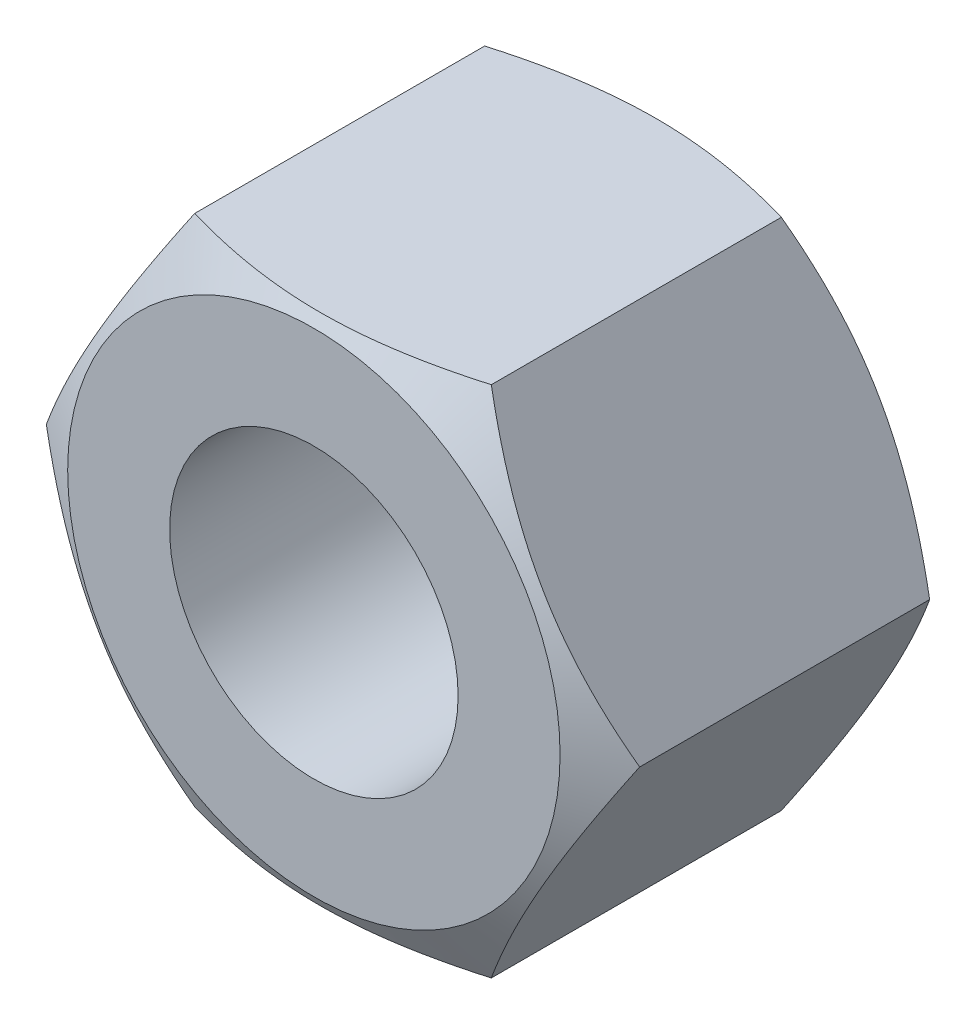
ISO-10303-21;
HEADER;
FILE_DESCRIPTION(('STEP AP214'),'2;1');
FILE_NAME('part.step','',(''),(''),'','','');
FILE_SCHEMA(('AUTOMOTIVE_DESIGN { 1 0 10303 214 1 1 1 1 }'));
ENDSEC;
DATA;
#1=APPLICATION_CONTEXT('core data for automotive mechanical design processes');
#2=APPLICATION_PROTOCOL_DEFINITION('international standard','automotive_design',2000,#1);
#3=PRODUCT_CONTEXT('',#1,'mechanical');
#4=PRODUCT('Part','Part','',(#3));
#5=PRODUCT_RELATED_PRODUCT_CATEGORY('part','',(#4));
#6=PRODUCT_DEFINITION_FORMATION('','',#4);
#7=PRODUCT_DEFINITION_CONTEXT('part definition',#1,'design');
#8=PRODUCT_DEFINITION('design','',#6,#7);
#9=PRODUCT_DEFINITION_SHAPE('','',#8);
#10=(LENGTH_UNIT() NAMED_UNIT(*) SI_UNIT(.MILLI.,.METRE.));
#11=(NAMED_UNIT(*) PLANE_ANGLE_UNIT() SI_UNIT($,.RADIAN.));
#12=(NAMED_UNIT(*) SI_UNIT($,.STERADIAN.) SOLID_ANGLE_UNIT());
#13=UNCERTAINTY_MEASURE_WITH_UNIT(LENGTH_MEASURE(1.E-05),#10,'distance_accuracy_value','');
#14=(GEOMETRIC_REPRESENTATION_CONTEXT(3) GLOBAL_UNCERTAINTY_ASSIGNED_CONTEXT((#13)) GLOBAL_UNIT_ASSIGNED_CONTEXT((#10,
#11,#12)) REPRESENTATION_CONTEXT('',''));
#15=CARTESIAN_POINT('',(0.,0.,0.));
#16=DIRECTION('',(0.,0.,1.));
#17=DIRECTION('',(1.,0.,0.));
#18=AXIS2_PLACEMENT_3D('',#15,#16,#17);
#19=CARTESIAN_POINT('',(-5.19615242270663,-9.,-12.2));
#20=DIRECTION('',(0.,-1.,0.));
#21=DIRECTION('',(1.,0.,0.));
#22=AXIS2_PLACEMENT_3D('',#19,#20,#21);
#23=PLANE('',#22);
#24=CARTESIAN_POINT('',(-13.7509549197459,-9.,-4.50874615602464));
#25=CARTESIAN_POINT('',(-13.5535031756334,-9.,-4.41336320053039));
#26=CARTESIAN_POINT('',(-13.3558119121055,-9.,-4.3184763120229));
#27=CARTESIAN_POINT('',(-12.9598997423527,-9.,-4.12980860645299));
#28=CARTESIAN_POINT('',(-12.7616788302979,-9.,-4.03602780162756));
#29=CARTESIAN_POINT('',(-12.1660871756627,-9.,-3.75648801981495));
#30=CARTESIAN_POINT('',(-11.7678522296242,-9.,-3.57256302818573));
#31=CARTESIAN_POINT('',(-10.9663259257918,-9.,-3.20973828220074));
#32=CARTESIAN_POINT('',(-10.5630186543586,-9.,-3.03087359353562));
#33=CARTESIAN_POINT('',(-9.75307886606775,-9.,-2.68086718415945));
#34=CARTESIAN_POINT('',(-9.34644652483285,-9.,-2.50972505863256));
#35=CARTESIAN_POINT('',(-8.52430065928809,-9.,-2.1752489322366));
#36=CARTESIAN_POINT('',(-8.10873905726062,-9.,-2.01203245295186));
#37=CARTESIAN_POINT('',(-7.27270479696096,-9.,-1.69845734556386));
#38=CARTESIAN_POINT('',(-6.85223159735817,-9.,-1.54810015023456));
#39=CARTESIAN_POINT('',(-6.00657361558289,-9.,-1.26430650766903));
#40=CARTESIAN_POINT('',(-5.58140112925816,-9.,-1.13083382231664));
#41=CARTESIAN_POINT('',(-4.72502847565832,-9.,-0.885160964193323));
#42=CARTESIAN_POINT('',(-4.29383026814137,-9.,-0.772954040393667));
#43=CARTESIAN_POINT('',(-3.42502754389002,-9.,-0.575284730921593));
#44=CARTESIAN_POINT('',(-2.98742098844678,-9.,-0.489831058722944));
#45=CARTESIAN_POINT('',(-2.32718643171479,-9.,-0.386011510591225));
#46=CARTESIAN_POINT('',(-2.10644379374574,-9.,-0.35546292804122));
#47=CARTESIAN_POINT('',(-1.66393320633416,-9.,-0.303087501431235));
#48=CARTESIAN_POINT('',(-1.44216535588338,-9.,-0.281259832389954));
#49=CARTESIAN_POINT('',(-0.99929464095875,-9.,-0.246912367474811));
#50=CARTESIAN_POINT('',(-0.778196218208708,-9.,-0.23433552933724));
#51=CARTESIAN_POINT('',(-0.335665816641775,-9.,-0.218555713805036));
#52=CARTESIAN_POINT('',(-0.114233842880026,-9.,-0.21535259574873));
#53=CARTESIAN_POINT('',(0.328504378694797,-9.,-0.218396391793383));
#54=CARTESIAN_POINT('',(0.549810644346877,-9.,-0.224640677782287));
#55=CARTESIAN_POINT('',(0.99196828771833,-9.,-0.246424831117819));
#56=CARTESIAN_POINT('',(1.21281964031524,-9.,-0.261965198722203));
#57=CARTESIAN_POINT('',(1.74889913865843,-9.,-0.310646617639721));
#58=CARTESIAN_POINT('',(2.0637085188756,-9.,-0.348489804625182));
#59=CARTESIAN_POINT('',(2.69084086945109,-9.,-0.440950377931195));
#60=CARTESIAN_POINT('',(3.00316345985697,-9.,-0.49557027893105));
#61=CARTESIAN_POINT('',(3.93695589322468,-9.,-0.681853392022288));
#62=CARTESIAN_POINT('',(4.55402787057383,-9.,-0.835814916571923));
#63=CARTESIAN_POINT('',(5.47700556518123,-9.,-1.10103782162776));
#64=CARTESIAN_POINT('',(5.78774000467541,-9.,-1.19644657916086));
#65=CARTESIAN_POINT('',(6.40620708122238,-9.,-1.3967158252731));
#66=CARTESIAN_POINT('',(6.71393944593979,-9.,-1.50157716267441));
#67=CARTESIAN_POINT('',(7.32486593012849,-9.,-1.71850923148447));
#68=CARTESIAN_POINT('',(7.62807586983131,-9.,-1.83053586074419));
#69=CARTESIAN_POINT('',(8.23191944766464,-9.,-2.06103780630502));
#70=CARTESIAN_POINT('',(8.53255393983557,-9.,-2.17951088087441));
#71=CARTESIAN_POINT('',(8.83210470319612,-9.,-2.30060285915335));
#72=B_SPLINE_CURVE_WITH_KNOTS('',3,(#24,#25,#26,#27,#28,#29,#30,#31,#32,#33,#34,#35,#36,#37,#38,
#39,#40,#41,#42,#43,#44,#45,#46,#47,#48,#49,#50,#51,#52,#53,#54,#55,#56,#57,#58,#59,#60,#61,#62,
#63,#64,#65,#66,#67,#68,#69,#70,#71),.UNSPECIFIED.,.F.,.F.,(4,2,2,2,2,2,2,2,2,2,2,2,2,2,2,2,2,2,
2,2,2,2,2,4),(0.,0.657848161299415,1.31570359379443,2.63163017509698,3.95513983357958,
5.27858003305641,6.61781030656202,7.95718960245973,9.29364366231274,10.6296727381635,
11.9661365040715,12.6345305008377,13.3028612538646,13.9670355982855,14.6311999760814,
15.2951796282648,15.9591950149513,16.9098816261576,17.8607108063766,19.766039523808,
20.7411201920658,21.7162885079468,22.6859446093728,23.6552656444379),.UNSPECIFIED.);
#73=CARTESIAN_POINT('',(-5.19615242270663,-9.,-1.02035392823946));
#74=VERTEX_POINT('',#73);
#75=CARTESIAN_POINT('',(5.19615242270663,-9.,-1.02035392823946));
#76=VERTEX_POINT('',#75);
#77=EDGE_CURVE('E52',#74,#76,#72,.T.);
#78=ORIENTED_EDGE('',*,*,#77,.F.);
#79=DIRECTION('',(0.,0.,1.));
#80=VECTOR('',#79,1.);
#81=CARTESIAN_POINT('',(-5.19615242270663,-9.,-12.2));
#82=LINE('',#81,#80);
#83=CARTESIAN_POINT('',(-5.19615242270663,-9.,-11.1796460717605));
#84=VERTEX_POINT('',#83);
#85=EDGE_CURVE('E11',#84,#74,#82,.T.);
#86=ORIENTED_EDGE('',*,*,#85,.F.);
#87=CARTESIAN_POINT('',(-13.7509549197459,-9.,-7.69125384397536));
#88=CARTESIAN_POINT('',(-13.5535031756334,-9.,-7.78663679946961));
#89=CARTESIAN_POINT('',(-13.3558119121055,-9.,-7.8815236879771));
#90=CARTESIAN_POINT('',(-12.9598997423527,-9.,-8.07019139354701));
#91=CARTESIAN_POINT('',(-12.7616788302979,-9.,-8.16397219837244));
#92=CARTESIAN_POINT('',(-12.1660871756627,-9.,-8.44351198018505));
#93=CARTESIAN_POINT('',(-11.7678522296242,-9.,-8.62743697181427));
#94=CARTESIAN_POINT('',(-10.9663259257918,-9.,-8.99026171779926));
#95=CARTESIAN_POINT('',(-10.5630186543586,-9.,-9.16912640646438));
#96=CARTESIAN_POINT('',(-9.75307886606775,-9.,-9.51913281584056));
#97=CARTESIAN_POINT('',(-9.34644652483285,-9.,-9.69027494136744));
#98=CARTESIAN_POINT('',(-8.52430065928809,-9.,-10.0247510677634));
#99=CARTESIAN_POINT('',(-8.10873905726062,-9.,-10.1879675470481));
#100=CARTESIAN_POINT('',(-7.27270479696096,-9.,-10.5015426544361));
#101=CARTESIAN_POINT('',(-6.85223159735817,-9.,-10.6518998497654));
#102=CARTESIAN_POINT('',(-6.0065736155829,-9.,-10.935693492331));
#103=CARTESIAN_POINT('',(-5.58140112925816,-9.,-11.0691661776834));
#104=CARTESIAN_POINT('',(-4.72502847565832,-9.,-11.3148390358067));
#105=CARTESIAN_POINT('',(-4.29383026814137,-9.,-11.4270459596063));
#106=CARTESIAN_POINT('',(-3.42502754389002,-9.,-11.6247152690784));
#107=CARTESIAN_POINT('',(-2.98742098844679,-9.,-11.7101689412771));
#108=CARTESIAN_POINT('',(-2.32718643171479,-9.,-11.8139884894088));
#109=CARTESIAN_POINT('',(-2.10644379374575,-9.,-11.8445370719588));
#110=CARTESIAN_POINT('',(-1.66393320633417,-9.,-11.8969124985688));
#111=CARTESIAN_POINT('',(-1.44216535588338,-9.,-11.91874016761));
#112=CARTESIAN_POINT('',(-0.999294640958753,-9.,-11.9530876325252));
#113=CARTESIAN_POINT('',(-0.77819621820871,-9.,-11.9656644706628));
#114=CARTESIAN_POINT('',(-0.335665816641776,-9.,-11.981444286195));
#115=CARTESIAN_POINT('',(-0.114233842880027,-9.,-11.9846474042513));
#116=CARTESIAN_POINT('',(0.328504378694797,-9.,-11.9816036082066));
#117=CARTESIAN_POINT('',(0.549810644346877,-9.,-11.9753593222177));
#118=CARTESIAN_POINT('',(0.99196828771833,-9.,-11.9535751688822));
#119=CARTESIAN_POINT('',(1.21281964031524,-9.,-11.9380348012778));
#120=CARTESIAN_POINT('',(1.74889913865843,-9.,-11.8893533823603));
#121=CARTESIAN_POINT('',(2.0637085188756,-9.,-11.8515101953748));
#122=CARTESIAN_POINT('',(2.69084086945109,-9.,-11.7590496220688));
#123=CARTESIAN_POINT('',(3.00316345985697,-9.,-11.7044297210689));
#124=CARTESIAN_POINT('',(3.93695589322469,-9.,-11.5181466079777));
#125=CARTESIAN_POINT('',(4.55402787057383,-9.,-11.3641850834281));
#126=CARTESIAN_POINT('',(5.47700556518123,-9.,-11.0989621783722));
#127=CARTESIAN_POINT('',(5.78774000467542,-9.,-11.0035534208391));
#128=CARTESIAN_POINT('',(6.40620708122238,-9.,-10.8032841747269));
#129=CARTESIAN_POINT('',(6.7139394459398,-9.,-10.6984228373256));
#130=CARTESIAN_POINT('',(7.32486593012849,-9.,-10.4814907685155));
#131=CARTESIAN_POINT('',(7.62807586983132,-9.,-10.3694641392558));
#132=CARTESIAN_POINT('',(8.23191944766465,-9.,-10.138962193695));
#133=CARTESIAN_POINT('',(8.53255393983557,-9.,-10.0204891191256));
#134=CARTESIAN_POINT('',(8.83210470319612,-9.,-9.89939714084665));
#135=B_SPLINE_CURVE_WITH_KNOTS('',3,(#87,#88,#89,#90,#91,#92,#93,#94,#95,#96,#97,#98,#99,#100,
#101,#102,#103,#104,#105,#106,#107,#108,#109,#110,#111,#112,#113,#114,#115,#116,#117,#118,#119,
#120,#121,#122,#123,#124,#125,#126,#127,#128,#129,#130,#131,#132,#133,#134),.UNSPECIFIED.,.F.,
.F.,(4,2,2,2,2,2,2,2,2,2,2,2,2,2,2,2,2,2,2,2,2,2,2,4),(0.,0.657848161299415,1.31570359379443,
2.63163017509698,3.95513983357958,5.27858003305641,6.61781030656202,7.95718960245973,
9.29364366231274,10.6296727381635,11.9661365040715,12.6345305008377,13.3028612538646,
13.9670355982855,14.6311999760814,15.2951796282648,15.9591950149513,16.9098816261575,
17.8607108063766,19.766039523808,20.7411201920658,21.7162885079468,22.6859446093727,
23.6552656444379),.UNSPECIFIED.);
#136=CARTESIAN_POINT('',(5.19615242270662,-9.00000000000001,-11.1796460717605));
#137=VERTEX_POINT('',#136);
#138=EDGE_CURVE('E131',#137,#84,#135,.F.);
#139=ORIENTED_EDGE('',*,*,#138,.F.);
#140=DIRECTION('',(0.,0.,1.));
#141=VECTOR('',#140,1.);
#142=CARTESIAN_POINT('',(5.19615242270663,-9.,-12.2));
#143=LINE('',#142,#141);
#144=EDGE_CURVE('E39',#137,#76,#143,.T.);
#145=ORIENTED_EDGE('',*,*,#144,.T.);
#146=EDGE_LOOP('',(#78,#86,#139,#145));
#147=FACE_BOUND('',#146,.T.);
#148=ADVANCED_FACE('F35',(#147),#23,.T.);
#149=CARTESIAN_POINT('',(-10.3923048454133,0.,-12.2));
#150=DIRECTION('',(-0.866025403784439,-0.5,0.));
#151=DIRECTION('',(0.5,-0.866025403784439,0.));
#152=AXIS2_PLACEMENT_3D('',#149,#150,#151);
#153=PLANE('',#152);
#154=CARTESIAN_POINT('',(-10.3924203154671,0.000200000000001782,-1.02042059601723));
#155=CARTESIAN_POINT('',(-10.2782163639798,-0.197607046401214,-0.95448835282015));
#156=CARTESIAN_POINT('',(-10.1635669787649,-0.396185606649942,-0.891547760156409));
#157=CARTESIAN_POINT('',(-9.9333371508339,-0.794955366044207,-0.772475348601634));
#158=CARTESIAN_POINT('',(-9.81775632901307,-0.995147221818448,-0.716346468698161));
#159=CARTESIAN_POINT('',(-9.58544915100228,-1.39751505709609,-0.611658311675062));
#160=CARTESIAN_POINT('',(-9.46872074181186,-1.59969459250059,-0.563117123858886));
#161=CARTESIAN_POINT('',(-9.23447001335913,-2.00542875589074,-0.474654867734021));
#162=CARTESIAN_POINT('',(-9.11694786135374,-2.20898309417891,-0.434732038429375));
#163=CARTESIAN_POINT('',(-8.88408932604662,-2.61230590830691,-0.365191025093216));
#164=CARTESIAN_POINT('',(-8.76877014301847,-2.812044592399,-0.335343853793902));
#165=CARTESIAN_POINT('',(-8.53761579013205,-3.21241567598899,-0.285299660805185));
#166=CARTESIAN_POINT('',(-8.42178066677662,-3.4130479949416,-0.265101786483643));
#167=CARTESIAN_POINT('',(-8.18990950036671,-3.81466063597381,-0.23486069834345));
#168=CARTESIAN_POINT('',(-8.07387383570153,-4.01564030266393,-0.224805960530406));
#169=CARTESIAN_POINT('',(-7.84169571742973,-4.41778459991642,-0.215068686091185));
#170=CARTESIAN_POINT('',(-7.72555326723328,-4.61894922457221,-0.21538582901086));
#171=CARTESIAN_POINT('',(-7.50842142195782,-4.99503261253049,-0.225670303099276));
#172=CARTESIAN_POINT('',(-7.40741671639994,-5.16997789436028,-0.234383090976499));
#173=CARTESIAN_POINT('',(-7.20564389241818,-5.51945867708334,-0.259483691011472));
#174=CARTESIAN_POINT('',(-7.10487579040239,-5.69399414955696,-0.275872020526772));
#175=CARTESIAN_POINT('',(-6.8029615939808,-6.2169248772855,-0.336162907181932));
#176=CARTESIAN_POINT('',(-6.60234990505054,-6.56439451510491,-0.39118383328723));
#177=CARTESIAN_POINT('',(-6.19899850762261,-7.263019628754,-0.528736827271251));
#178=CARTESIAN_POINT('',(-5.99631027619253,-7.61408594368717,-0.611851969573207));
#179=CARTESIAN_POINT('',(-5.59395639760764,-8.3109833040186,-0.80048889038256));
#180=CARTESIAN_POINT('',(-5.39428559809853,-8.65682327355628,-0.905966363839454));
#181=CARTESIAN_POINT('',(-5.19603695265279,-9.0002,-1.02042059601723));
#182=B_SPLINE_CURVE_WITH_KNOTS('',3,(#154,#155,#156,#157,#158,#159,#160,#161,#162,#163,#164,
#165,#166,#167,#168,#169,#170,#171,#172,#173,#174,#175,#176,#177,#178,#179,#180,#181),
.UNSPECIFIED.,.F.,.F.,(4,2,2,2,2,2,2,2,2,2,2,2,2,4),(0.,0.713219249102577,1.42674513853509,
2.14194697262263,2.8570025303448,3.55449749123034,4.25193080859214,4.94857085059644,
5.64518936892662,6.25162976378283,6.8581110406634,8.07193747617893,9.31268391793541,
10.5509947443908),.UNSPECIFIED.);
#183=CARTESIAN_POINT('',(-10.3923048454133,0.,-1.02035392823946));
#184=VERTEX_POINT('',#183);
#185=EDGE_CURVE('E92',#184,#74,#182,.T.);
#186=ORIENTED_EDGE('',*,*,#185,.F.);
#187=DIRECTION('',(0.,0.,1.));
#188=VECTOR('',#187,1.);
#189=CARTESIAN_POINT('',(-10.3923048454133,0.,-12.2));
#190=LINE('',#189,#188);
#191=CARTESIAN_POINT('',(-10.3923048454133,0.,-11.1796460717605));
#192=VERTEX_POINT('',#191);
#193=EDGE_CURVE('E44',#192,#184,#190,.T.);
#194=ORIENTED_EDGE('',*,*,#193,.F.);
#195=CARTESIAN_POINT('',(-5.19603695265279,-9.0002,-11.1795794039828));
#196=CARTESIAN_POINT('',(-5.31024090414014,-8.80239295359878,-11.2455116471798));
#197=CARTESIAN_POINT('',(-5.42489028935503,-8.60381439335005,-11.3084522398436));
#198=CARTESIAN_POINT('',(-5.65512011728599,-8.20504463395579,-11.4275246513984));
#199=CARTESIAN_POINT('',(-5.77070093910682,-8.00485277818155,-11.4836535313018));
#200=CARTESIAN_POINT('',(-6.00300811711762,-7.6024849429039,-11.5883416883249));
#201=CARTESIAN_POINT('',(-6.11973652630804,-7.4003054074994,-11.6368828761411));
#202=CARTESIAN_POINT('',(-6.35398725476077,-6.99457124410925,-11.725345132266));
#203=CARTESIAN_POINT('',(-6.47150940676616,-6.79101690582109,-11.7652679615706));
#204=CARTESIAN_POINT('',(-6.70436794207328,-6.38769409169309,-11.8348089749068));
#205=CARTESIAN_POINT('',(-6.81968712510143,-6.187955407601,-11.8646561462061));
#206=CARTESIAN_POINT('',(-7.05084147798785,-5.78758432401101,-11.9147003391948));
#207=CARTESIAN_POINT('',(-7.16667660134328,-5.5869520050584,-11.9348982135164));
#208=CARTESIAN_POINT('',(-7.39854776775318,-5.18533936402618,-11.9651393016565));
#209=CARTESIAN_POINT('',(-7.51458343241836,-4.98435969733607,-11.9751940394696));
#210=CARTESIAN_POINT('',(-7.74676155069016,-4.58221540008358,-11.9849313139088));
#211=CARTESIAN_POINT('',(-7.86290400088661,-4.38105077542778,-11.9846141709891));
#212=CARTESIAN_POINT('',(-8.08003584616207,-4.0049673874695,-11.9743296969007));
#213=CARTESIAN_POINT('',(-8.18104055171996,-3.83002210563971,-11.9656169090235));
#214=CARTESIAN_POINT('',(-8.38281337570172,-3.48054132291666,-11.9405163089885));
#215=CARTESIAN_POINT('',(-8.4835814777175,-3.30600585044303,-11.9241279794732));
#216=CARTESIAN_POINT('',(-8.7854956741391,-2.7830751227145,-11.8638370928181));
#217=CARTESIAN_POINT('',(-8.98610736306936,-2.43560548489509,-11.8088161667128));
#218=CARTESIAN_POINT('',(-9.38945876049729,-1.736980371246,-11.6712631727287));
#219=CARTESIAN_POINT('',(-9.59214699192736,-1.38591405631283,-11.5881480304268));
#220=CARTESIAN_POINT('',(-9.99450087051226,-0.689016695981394,-11.3995111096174));
#221=CARTESIAN_POINT('',(-10.1941716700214,-0.34317672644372,-11.2940336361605));
#222=CARTESIAN_POINT('',(-10.3924203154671,0.000200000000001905,-11.1795794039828));
#223=B_SPLINE_CURVE_WITH_KNOTS('',3,(#195,#196,#197,#198,#199,#200,#201,#202,#203,#204,#205,
#206,#207,#208,#209,#210,#211,#212,#213,#214,#215,#216,#217,#218,#219,#220,#221,#222),
.UNSPECIFIED.,.F.,.F.,(4,2,2,2,2,2,2,2,2,2,2,2,2,4),(0.,0.713219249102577,1.42674513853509,
2.14194697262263,2.8570025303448,3.55449749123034,4.25193080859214,4.94857085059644,
5.64518936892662,6.25162976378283,6.8581110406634,8.07193747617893,9.31268391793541,
10.5509947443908),.UNSPECIFIED.);
#224=EDGE_CURVE('E139',#84,#192,#223,.T.);
#225=ORIENTED_EDGE('',*,*,#224,.F.);
#226=ORIENTED_EDGE('',*,*,#85,.T.);
#227=EDGE_LOOP('',(#186,#194,#225,#226));
#228=FACE_BOUND('',#227,.T.);
#229=ADVANCED_FACE('F102',(#228),#153,.T.);
#230=CARTESIAN_POINT('',(-5.19615242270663,9.00000000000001,-12.2));
#231=DIRECTION('',(-0.866025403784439,0.5,0.));
#232=DIRECTION('',(-0.5,-0.866025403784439,0.));
#233=AXIS2_PLACEMENT_3D('',#230,#231,#232);
#234=PLANE('',#233);
#235=CARTESIAN_POINT('',(-5.19603695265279,9.0002,-1.02042059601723));
#236=CARTESIAN_POINT('',(-5.31024090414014,8.80239295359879,-0.954488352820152));
#237=CARTESIAN_POINT('',(-5.42489028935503,8.60381439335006,-0.89154776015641));
#238=CARTESIAN_POINT('',(-5.65512011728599,8.2050446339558,-0.772475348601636));
#239=CARTESIAN_POINT('',(-5.77070093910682,8.00485277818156,-0.716346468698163));
#240=CARTESIAN_POINT('',(-6.00300811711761,7.60248494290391,-0.611658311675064));
#241=CARTESIAN_POINT('',(-6.11973652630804,7.40030540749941,-0.563117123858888));
#242=CARTESIAN_POINT('',(-6.35398725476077,6.99457124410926,-0.474654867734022));
#243=CARTESIAN_POINT('',(-6.47150940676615,6.7910169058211,-0.434732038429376));
#244=CARTESIAN_POINT('',(-6.70436794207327,6.38769409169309,-0.365191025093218));
#245=CARTESIAN_POINT('',(-6.81968712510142,6.187955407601,-0.335343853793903));
#246=CARTESIAN_POINT('',(-7.05084147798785,5.78758432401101,-0.285299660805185));
#247=CARTESIAN_POINT('',(-7.16667660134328,5.5869520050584,-0.265101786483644));
#248=CARTESIAN_POINT('',(-7.39854776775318,5.18533936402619,-0.234860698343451));
#249=CARTESIAN_POINT('',(-7.51458343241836,4.98435969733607,-0.224805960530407));
#250=CARTESIAN_POINT('',(-7.74676155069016,4.58221540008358,-0.215068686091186));
#251=CARTESIAN_POINT('',(-7.86290400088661,4.38105077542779,-0.215385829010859));
#252=CARTESIAN_POINT('',(-8.08003584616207,4.00496738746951,-0.225670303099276));
#253=CARTESIAN_POINT('',(-8.18104055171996,3.83002210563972,-0.234383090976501));
#254=CARTESIAN_POINT('',(-8.38281337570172,3.48054132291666,-0.259483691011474));
#255=CARTESIAN_POINT('',(-8.4835814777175,3.30600585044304,-0.275872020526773));
#256=CARTESIAN_POINT('',(-8.78549567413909,2.7830751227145,-0.336162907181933));
#257=CARTESIAN_POINT('',(-8.98610736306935,2.43560548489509,-0.391183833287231));
#258=CARTESIAN_POINT('',(-9.38945876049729,1.736980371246,-0.528736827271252));
#259=CARTESIAN_POINT('',(-9.59214699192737,1.38591405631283,-0.611851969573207));
#260=CARTESIAN_POINT('',(-9.99450087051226,0.689016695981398,-0.80048889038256));
#261=CARTESIAN_POINT('',(-10.1941716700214,0.343176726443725,-0.905966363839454));
#262=CARTESIAN_POINT('',(-10.3924203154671,-0.000199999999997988,-1.02042059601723));
#263=B_SPLINE_CURVE_WITH_KNOTS('',3,(#235,#236,#237,#238,#239,#240,#241,#242,#243,#244,#245,
#246,#247,#248,#249,#250,#251,#252,#253,#254,#255,#256,#257,#258,#259,#260,#261,#262),
.UNSPECIFIED.,.F.,.F.,(4,2,2,2,2,2,2,2,2,2,2,2,2,4),(0.,0.713219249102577,1.42674513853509,
2.14194697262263,2.8570025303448,3.55449749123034,4.25193080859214,4.94857085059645,
5.64518936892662,6.25162976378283,6.8581110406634,8.07193747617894,9.31268391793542,
10.5509947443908),.UNSPECIFIED.);
#264=CARTESIAN_POINT('',(-5.19615242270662,9.00000000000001,-1.02035392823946));
#265=VERTEX_POINT('',#264);
#266=EDGE_CURVE('E88',#265,#184,#263,.T.);
#267=ORIENTED_EDGE('',*,*,#266,.F.);
#268=DIRECTION('',(0.,0.,1.));
#269=VECTOR('',#268,1.);
#270=CARTESIAN_POINT('',(-5.19615242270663,9.00000000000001,-12.2));
#271=LINE('',#270,#269);
#272=CARTESIAN_POINT('',(-5.19615242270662,9.00000000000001,-11.1796460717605));
#273=VERTEX_POINT('',#272);
#274=EDGE_CURVE('E109',#273,#265,#271,.T.);
#275=ORIENTED_EDGE('',*,*,#274,.F.);
#276=CARTESIAN_POINT('',(-10.3924203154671,-0.000199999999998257,-11.1795794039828));
#277=CARTESIAN_POINT('',(-10.2782163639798,0.197607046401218,-11.2455116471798));
#278=CARTESIAN_POINT('',(-10.1635669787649,0.396185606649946,-11.3084522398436));
#279=CARTESIAN_POINT('',(-9.9333371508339,0.79495536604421,-11.4275246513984));
#280=CARTESIAN_POINT('',(-9.81775632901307,0.995147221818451,-11.4836535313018));
#281=CARTESIAN_POINT('',(-9.58544915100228,1.3975150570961,-11.5883416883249));
#282=CARTESIAN_POINT('',(-9.46872074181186,1.5996945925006,-11.6368828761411));
#283=CARTESIAN_POINT('',(-9.23447001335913,2.00542875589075,-11.725345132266));
#284=CARTESIAN_POINT('',(-9.11694786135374,2.20898309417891,-11.7652679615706));
#285=CARTESIAN_POINT('',(-8.88408932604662,2.61230590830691,-11.8348089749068));
#286=CARTESIAN_POINT('',(-8.76877014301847,2.812044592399,-11.8646561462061));
#287=CARTESIAN_POINT('',(-8.53761579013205,3.21241567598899,-11.9147003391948));
#288=CARTESIAN_POINT('',(-8.42178066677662,3.4130479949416,-11.9348982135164));
#289=CARTESIAN_POINT('',(-8.18990950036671,3.81466063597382,-11.9651393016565));
#290=CARTESIAN_POINT('',(-8.07387383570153,4.01564030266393,-11.9751940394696));
#291=CARTESIAN_POINT('',(-7.84169571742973,4.41778459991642,-11.9849313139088));
#292=CARTESIAN_POINT('',(-7.72555326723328,4.61894922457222,-11.9846141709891));
#293=CARTESIAN_POINT('',(-7.50842142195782,4.9950326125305,-11.9743296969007));
#294=CARTESIAN_POINT('',(-7.40741671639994,5.16997789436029,-11.9656169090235));
#295=CARTESIAN_POINT('',(-7.20564389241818,5.51945867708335,-11.9405163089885));
#296=CARTESIAN_POINT('',(-7.10487579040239,5.69399414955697,-11.9241279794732));
#297=CARTESIAN_POINT('',(-6.8029615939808,6.21692487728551,-11.8638370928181));
#298=CARTESIAN_POINT('',(-6.60234990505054,6.56439451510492,-11.8088161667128));
#299=CARTESIAN_POINT('',(-6.1989985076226,7.263019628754,-11.6712631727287));
#300=CARTESIAN_POINT('',(-5.99631027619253,7.61408594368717,-11.5881480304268));
#301=CARTESIAN_POINT('',(-5.59395639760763,8.31098330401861,-11.3995111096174));
#302=CARTESIAN_POINT('',(-5.39428559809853,8.65682327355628,-11.2940336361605));
#303=CARTESIAN_POINT('',(-5.19603695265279,9.0002,-11.1795794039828));
#304=B_SPLINE_CURVE_WITH_KNOTS('',3,(#276,#277,#278,#279,#280,#281,#282,#283,#284,#285,#286,
#287,#288,#289,#290,#291,#292,#293,#294,#295,#296,#297,#298,#299,#300,#301,#302,#303),
.UNSPECIFIED.,.F.,.F.,(4,2,2,2,2,2,2,2,2,2,2,2,2,4),(0.,0.713219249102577,1.42674513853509,
2.14194697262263,2.8570025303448,3.55449749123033,4.25193080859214,4.94857085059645,
5.64518936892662,6.25162976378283,6.8581110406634,8.07193747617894,9.31268391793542,
10.5509947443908),.UNSPECIFIED.);
#305=EDGE_CURVE('E108',#192,#273,#304,.T.);
#306=ORIENTED_EDGE('',*,*,#305,.F.);
#307=ORIENTED_EDGE('',*,*,#193,.T.);
#308=EDGE_LOOP('',(#267,#275,#306,#307));
#309=FACE_BOUND('',#308,.T.);
#310=ADVANCED_FACE('F107',(#309),#234,.T.);
#311=CARTESIAN_POINT('',(5.19615242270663,9.00000000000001,-12.2));
#312=DIRECTION('',(0.,1.,0.));
#313=DIRECTION('',(0.,0.,1.));
#314=AXIS2_PLACEMENT_3D('',#311,#312,#313);
#315=PLANE('',#314);
#316=CARTESIAN_POINT('',(-13.7509549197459,9.00000000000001,-4.50874615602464));
#317=CARTESIAN_POINT('',(-13.5535031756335,9.00000000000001,-4.4133632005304));
#318=CARTESIAN_POINT('',(-13.3558119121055,9.00000000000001,-4.31847631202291));
#319=CARTESIAN_POINT('',(-12.9598997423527,9.00000000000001,-4.12980860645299));
#320=CARTESIAN_POINT('',(-12.7616788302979,9.00000000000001,-4.03602780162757));
#321=CARTESIAN_POINT('',(-12.1660871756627,9.00000000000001,-3.75648801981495));
#322=CARTESIAN_POINT('',(-11.7678522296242,9.00000000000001,-3.57256302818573));
#323=CARTESIAN_POINT('',(-10.9663259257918,9.00000000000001,-3.20973828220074));
#324=CARTESIAN_POINT('',(-10.5630186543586,9.00000000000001,-3.03087359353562));
#325=CARTESIAN_POINT('',(-9.75307886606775,9.00000000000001,-2.68086718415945));
#326=CARTESIAN_POINT('',(-9.34644652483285,9.00000000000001,-2.50972505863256));
#327=CARTESIAN_POINT('',(-8.52430065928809,9.00000000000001,-2.1752489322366));
#328=CARTESIAN_POINT('',(-8.10873905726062,9.00000000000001,-2.01203245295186));
#329=CARTESIAN_POINT('',(-7.27270479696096,9.00000000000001,-1.69845734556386));
#330=CARTESIAN_POINT('',(-6.85223159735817,9.00000000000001,-1.54810015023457));
#331=CARTESIAN_POINT('',(-6.00657361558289,9.00000000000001,-1.26430650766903));
#332=CARTESIAN_POINT('',(-5.58140112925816,9.00000000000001,-1.13083382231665));
#333=CARTESIAN_POINT('',(-4.72502847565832,9.00000000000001,-0.885160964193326));
#334=CARTESIAN_POINT('',(-4.29383026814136,9.00000000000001,-0.77295404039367));
#335=CARTESIAN_POINT('',(-3.42502754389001,9.00000000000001,-0.575284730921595));
#336=CARTESIAN_POINT('',(-2.98742098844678,9.00000000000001,-0.489831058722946));
#337=CARTESIAN_POINT('',(-2.32718643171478,9.00000000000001,-0.386011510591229));
#338=CARTESIAN_POINT('',(-2.10644379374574,9.00000000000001,-0.355462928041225));
#339=CARTESIAN_POINT('',(-1.66393320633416,9.00000000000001,-0.303087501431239));
#340=CARTESIAN_POINT('',(-1.44216535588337,9.00000000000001,-0.281259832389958));
#341=CARTESIAN_POINT('',(-0.999294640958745,9.00000000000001,-0.246912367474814));
#342=CARTESIAN_POINT('',(-0.778196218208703,9.00000000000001,-0.234335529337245));
#343=CARTESIAN_POINT('',(-0.33566581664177,9.00000000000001,-0.218555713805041));
#344=CARTESIAN_POINT('',(-0.114233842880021,9.00000000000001,-0.215352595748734));
#345=CARTESIAN_POINT('',(0.328504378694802,9.00000000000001,-0.218396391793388));
#346=CARTESIAN_POINT('',(0.549810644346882,9.00000000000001,-0.224640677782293));
#347=CARTESIAN_POINT('',(0.991968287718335,9.00000000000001,-0.246424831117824));
#348=CARTESIAN_POINT('',(1.21281964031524,9.00000000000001,-0.261965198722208));
#349=CARTESIAN_POINT('',(1.74889913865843,9.00000000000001,-0.310646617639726));
#350=CARTESIAN_POINT('',(2.06370851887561,9.00000000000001,-0.348489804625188));
#351=CARTESIAN_POINT('',(2.6908408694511,9.00000000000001,-0.440950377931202));
#352=CARTESIAN_POINT('',(3.00316345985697,9.00000000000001,-0.495570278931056));
#353=CARTESIAN_POINT('',(3.93695589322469,9.00000000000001,-0.681853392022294));
#354=CARTESIAN_POINT('',(4.55402787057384,9.00000000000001,-0.83581491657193));
#355=CARTESIAN_POINT('',(5.47700556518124,9.00000000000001,-1.10103782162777));
#356=CARTESIAN_POINT('',(5.78774000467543,9.00000000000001,-1.19644657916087));
#357=CARTESIAN_POINT('',(6.40620708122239,9.00000000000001,-1.3967158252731));
#358=CARTESIAN_POINT('',(6.71393944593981,9.00000000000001,-1.50157716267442));
#359=CARTESIAN_POINT('',(7.32486593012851,9.00000000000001,-1.71850923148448));
#360=CARTESIAN_POINT('',(7.62807586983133,9.00000000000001,-1.8305358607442));
#361=CARTESIAN_POINT('',(8.23191944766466,9.00000000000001,-2.06103780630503));
#362=CARTESIAN_POINT('',(8.53255393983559,9.00000000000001,-2.17951088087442));
#363=CARTESIAN_POINT('',(8.83210470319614,9.00000000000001,-2.30060285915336));
#364=B_SPLINE_CURVE_WITH_KNOTS('',3,(#316,#317,#318,#319,#320,#321,#322,#323,#324,#325,#326,
#327,#328,#329,#330,#331,#332,#333,#334,#335,#336,#337,#338,#339,#340,#341,#342,#343,#344,#345,
#346,#347,#348,#349,#350,#351,#352,#353,#354,#355,#356,#357,#358,#359,#360,#361,#362,#363),
.UNSPECIFIED.,.F.,.F.,(4,2,2,2,2,2,2,2,2,2,2,2,2,2,2,2,2,2,2,2,2,2,2,4),(0.,0.657848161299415,
1.31570359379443,2.63163017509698,3.95513983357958,5.27858003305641,6.61781030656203,
7.95718960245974,9.29364366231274,10.6296727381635,11.9661365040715,12.6345305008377,
13.3028612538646,13.9670355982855,14.6311999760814,15.2951796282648,15.9591950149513,
16.9098816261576,17.8607108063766,19.766039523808,20.7411201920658,21.7162885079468,
22.6859446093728,23.6552656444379),.UNSPECIFIED.);
#365=CARTESIAN_POINT('',(5.19615242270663,9.,-1.02035392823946));
#366=VERTEX_POINT('',#365);
#367=EDGE_CURVE('E94',#366,#265,#364,.F.);
#368=ORIENTED_EDGE('',*,*,#367,.F.);
#369=DIRECTION('',(0.,0.,1.));
#370=VECTOR('',#369,1.);
#371=CARTESIAN_POINT('',(5.19615242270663,9.00000000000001,-12.2));
#372=LINE('',#371,#370);
#373=CARTESIAN_POINT('',(5.19615242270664,9.,-11.1796460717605));
#374=VERTEX_POINT('',#373);
#375=EDGE_CURVE('E111',#374,#366,#372,.T.);
#376=ORIENTED_EDGE('',*,*,#375,.F.);
#377=CARTESIAN_POINT('',(-13.7509549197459,9.00000000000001,-7.69125384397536));
#378=CARTESIAN_POINT('',(-13.5535031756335,9.00000000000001,-7.7866367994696));
#379=CARTESIAN_POINT('',(-13.3558119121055,9.00000000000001,-7.88152368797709));
#380=CARTESIAN_POINT('',(-12.9598997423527,9.00000000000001,-8.07019139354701));
#381=CARTESIAN_POINT('',(-12.7616788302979,9.00000000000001,-8.16397219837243));
#382=CARTESIAN_POINT('',(-12.1660871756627,9.00000000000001,-8.44351198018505));
#383=CARTESIAN_POINT('',(-11.7678522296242,9.00000000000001,-8.62743697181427));
#384=CARTESIAN_POINT('',(-10.9663259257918,9.00000000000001,-8.99026171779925));
#385=CARTESIAN_POINT('',(-10.5630186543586,9.00000000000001,-9.16912640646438));
#386=CARTESIAN_POINT('',(-9.75307886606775,9.00000000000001,-9.51913281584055));
#387=CARTESIAN_POINT('',(-9.34644652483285,9.00000000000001,-9.69027494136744));
#388=CARTESIAN_POINT('',(-8.52430065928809,9.00000000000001,-10.0247510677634));
#389=CARTESIAN_POINT('',(-8.10873905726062,9.00000000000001,-10.1879675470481));
#390=CARTESIAN_POINT('',(-7.27270479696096,9.00000000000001,-10.5015426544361));
#391=CARTESIAN_POINT('',(-6.85223159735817,9.00000000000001,-10.6518998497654));
#392=CARTESIAN_POINT('',(-6.00657361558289,9.00000000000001,-10.935693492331));
#393=CARTESIAN_POINT('',(-5.58140112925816,9.00000000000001,-11.0691661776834));
#394=CARTESIAN_POINT('',(-4.72502847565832,9.00000000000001,-11.3148390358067));
#395=CARTESIAN_POINT('',(-4.29383026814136,9.00000000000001,-11.4270459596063));
#396=CARTESIAN_POINT('',(-3.42502754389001,9.00000000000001,-11.6247152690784));
#397=CARTESIAN_POINT('',(-2.98742098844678,9.00000000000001,-11.7101689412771));
#398=CARTESIAN_POINT('',(-2.32718643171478,9.00000000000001,-11.8139884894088));
#399=CARTESIAN_POINT('',(-2.10644379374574,9.00000000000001,-11.8445370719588));
#400=CARTESIAN_POINT('',(-1.66393320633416,9.00000000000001,-11.8969124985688));
#401=CARTESIAN_POINT('',(-1.44216535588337,9.00000000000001,-11.91874016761));
#402=CARTESIAN_POINT('',(-0.999294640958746,9.00000000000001,-11.9530876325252));
#403=CARTESIAN_POINT('',(-0.778196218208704,9.00000000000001,-11.9656644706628));
#404=CARTESIAN_POINT('',(-0.33566581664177,9.00000000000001,-11.981444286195));
#405=CARTESIAN_POINT('',(-0.114233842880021,9.00000000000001,-11.9846474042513));
#406=CARTESIAN_POINT('',(0.328504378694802,9.00000000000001,-11.9816036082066));
#407=CARTESIAN_POINT('',(0.549810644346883,9.00000000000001,-11.9753593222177));
#408=CARTESIAN_POINT('',(0.991968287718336,9.00000000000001,-11.9535751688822));
#409=CARTESIAN_POINT('',(1.21281964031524,9.00000000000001,-11.9380348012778));
#410=CARTESIAN_POINT('',(1.74889913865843,9.00000000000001,-11.8893533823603));
#411=CARTESIAN_POINT('',(2.06370851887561,9.00000000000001,-11.8515101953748));
#412=CARTESIAN_POINT('',(2.6908408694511,9.00000000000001,-11.7590496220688));
#413=CARTESIAN_POINT('',(3.00316345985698,9.00000000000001,-11.7044297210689));
#414=CARTESIAN_POINT('',(3.9369558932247,9.00000000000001,-11.5181466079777));
#415=CARTESIAN_POINT('',(4.55402787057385,9.00000000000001,-11.3641850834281));
#416=CARTESIAN_POINT('',(5.47700556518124,9.00000000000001,-11.0989621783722));
#417=CARTESIAN_POINT('',(5.78774000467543,9.00000000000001,-11.0035534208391));
#418=CARTESIAN_POINT('',(6.4062070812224,9.00000000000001,-10.8032841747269));
#419=CARTESIAN_POINT('',(6.71393944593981,9.00000000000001,-10.6984228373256));
#420=CARTESIAN_POINT('',(7.32486593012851,9.00000000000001,-10.4814907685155));
#421=CARTESIAN_POINT('',(7.62807586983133,9.00000000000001,-10.3694641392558));
#422=CARTESIAN_POINT('',(8.23191944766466,9.00000000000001,-10.138962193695));
#423=CARTESIAN_POINT('',(8.53255393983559,9.00000000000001,-10.0204891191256));
#424=CARTESIAN_POINT('',(8.83210470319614,9.00000000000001,-9.89939714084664));
#425=B_SPLINE_CURVE_WITH_KNOTS('',3,(#377,#378,#379,#380,#381,#382,#383,#384,#385,#386,#387,
#388,#389,#390,#391,#392,#393,#394,#395,#396,#397,#398,#399,#400,#401,#402,#403,#404,#405,#406,
#407,#408,#409,#410,#411,#412,#413,#414,#415,#416,#417,#418,#419,#420,#421,#422,#423,#424),
.UNSPECIFIED.,.F.,.F.,(4,2,2,2,2,2,2,2,2,2,2,2,2,2,2,2,2,2,2,2,2,2,2,4),(0.,0.657848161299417,
1.31570359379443,2.63163017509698,3.95513983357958,5.27858003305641,6.61781030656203,
7.95718960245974,9.29364366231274,10.6296727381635,11.9661365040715,12.6345305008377,
13.3028612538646,13.9670355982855,14.6311999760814,15.2951796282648,15.9591950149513,
16.9098816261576,17.8607108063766,19.766039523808,20.7411201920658,21.7162885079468,
22.6859446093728,23.6552656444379),.UNSPECIFIED.);
#426=EDGE_CURVE('E173',#273,#374,#425,.T.);
#427=ORIENTED_EDGE('',*,*,#426,.F.);
#428=ORIENTED_EDGE('',*,*,#274,.T.);
#429=EDGE_LOOP('',(#368,#376,#427,#428));
#430=FACE_BOUND('',#429,.T.);
#431=ADVANCED_FACE('F186',(#430),#315,.T.);
#432=CARTESIAN_POINT('',(10.3923048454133,0.,-12.2));
#433=DIRECTION('',(0.866025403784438,0.5,0.));
#434=DIRECTION('',(-0.5,0.866025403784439,0.));
#435=AXIS2_PLACEMENT_3D('',#432,#433,#434);
#436=PLANE('',#435);
#437=CARTESIAN_POINT('',(10.3924203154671,-0.000199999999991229,-1.02042059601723));
#438=CARTESIAN_POINT('',(10.2782163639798,0.197607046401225,-0.954488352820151));
#439=CARTESIAN_POINT('',(10.1635669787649,0.396185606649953,-0.891547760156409));
#440=CARTESIAN_POINT('',(9.9333371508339,0.794955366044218,-0.772475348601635));
#441=CARTESIAN_POINT('',(9.81775632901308,0.995147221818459,-0.716346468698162));
#442=CARTESIAN_POINT('',(9.58544915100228,1.39751505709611,-0.611658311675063));
#443=CARTESIAN_POINT('',(9.46872074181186,1.5996945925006,-0.563117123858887));
#444=CARTESIAN_POINT('',(9.23447001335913,2.00542875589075,-0.474654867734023));
#445=CARTESIAN_POINT('',(9.11694786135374,2.20898309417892,-0.434732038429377));
#446=CARTESIAN_POINT('',(8.88408932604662,2.61230590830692,-0.365191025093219));
#447=CARTESIAN_POINT('',(8.76877014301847,2.81204459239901,-0.335343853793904));
#448=CARTESIAN_POINT('',(8.53761579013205,3.212415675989,-0.285299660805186));
#449=CARTESIAN_POINT('',(8.42178066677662,3.41304799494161,-0.265101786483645));
#450=CARTESIAN_POINT('',(8.18990950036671,3.81466063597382,-0.234860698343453));
#451=CARTESIAN_POINT('',(8.07387383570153,4.01564030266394,-0.224805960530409));
#452=CARTESIAN_POINT('',(7.84169571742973,4.41778459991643,-0.215068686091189));
#453=CARTESIAN_POINT('',(7.72555326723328,4.61894922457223,-0.215385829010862));
#454=CARTESIAN_POINT('',(7.50842142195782,4.99503261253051,-0.225670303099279));
#455=CARTESIAN_POINT('',(7.40741671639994,5.1699778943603,-0.234383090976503));
#456=CARTESIAN_POINT('',(7.20564389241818,5.51945867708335,-0.259483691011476));
#457=CARTESIAN_POINT('',(7.10487579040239,5.69399414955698,-0.275872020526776));
#458=CARTESIAN_POINT('',(6.8029615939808,6.21692487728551,-0.336162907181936));
#459=CARTESIAN_POINT('',(6.60234990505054,6.56439451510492,-0.391183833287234));
#460=CARTESIAN_POINT('',(6.19899850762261,7.263019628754,-0.528736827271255));
#461=CARTESIAN_POINT('',(5.99631027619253,7.61408594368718,-0.611851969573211));
#462=CARTESIAN_POINT('',(5.59395639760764,8.31098330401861,-0.800488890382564));
#463=CARTESIAN_POINT('',(5.39428559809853,8.65682327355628,-0.905966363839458));
#464=CARTESIAN_POINT('',(5.19603695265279,9.0002,-1.02042059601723));
#465=B_SPLINE_CURVE_WITH_KNOTS('',3,(#437,#438,#439,#440,#441,#442,#443,#444,#445,#446,#447,
#448,#449,#450,#451,#452,#453,#454,#455,#456,#457,#458,#459,#460,#461,#462,#463,#464),
.UNSPECIFIED.,.F.,.F.,(4,2,2,2,2,2,2,2,2,2,2,2,2,4),(0.,0.713219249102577,1.42674513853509,
2.14194697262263,2.8570025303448,3.55449749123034,4.25193080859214,4.94857085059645,
5.64518936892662,6.25162976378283,6.8581110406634,8.07193747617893,9.31268391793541,
10.5509947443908),.UNSPECIFIED.);
#466=CARTESIAN_POINT('',(10.3923048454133,0.,-1.02035392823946));
#467=VERTEX_POINT('',#466);
#468=EDGE_CURVE('E221',#467,#366,#465,.T.);
#469=ORIENTED_EDGE('',*,*,#468,.F.);
#470=DIRECTION('',(0.,0.,1.));
#471=VECTOR('',#470,1.);
#472=CARTESIAN_POINT('',(10.3923048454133,0.,-12.2));
#473=LINE('',#472,#471);
#474=CARTESIAN_POINT('',(10.3923048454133,0.,-11.1796460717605));
#475=VERTEX_POINT('',#474);
#476=EDGE_CURVE('E116',#475,#467,#473,.T.);
#477=ORIENTED_EDGE('',*,*,#476,.F.);
#478=CARTESIAN_POINT('',(5.19603695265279,9.0002,-11.1795794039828));
#479=CARTESIAN_POINT('',(5.31024090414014,8.80239295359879,-11.2455116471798));
#480=CARTESIAN_POINT('',(5.42489028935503,8.60381439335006,-11.3084522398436));
#481=CARTESIAN_POINT('',(5.65512011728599,8.2050446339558,-11.4275246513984));
#482=CARTESIAN_POINT('',(5.77070093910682,8.00485277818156,-11.4836535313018));
#483=CARTESIAN_POINT('',(6.00300811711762,7.60248494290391,-11.5883416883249));
#484=CARTESIAN_POINT('',(6.11973652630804,7.40030540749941,-11.6368828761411));
#485=CARTESIAN_POINT('',(6.35398725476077,6.99457124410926,-11.725345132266));
#486=CARTESIAN_POINT('',(6.47150940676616,6.7910169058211,-11.7652679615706));
#487=CARTESIAN_POINT('',(6.70436794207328,6.38769409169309,-11.8348089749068));
#488=CARTESIAN_POINT('',(6.81968712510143,6.187955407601,-11.8646561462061));
#489=CARTESIAN_POINT('',(7.05084147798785,5.78758432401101,-11.9147003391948));
#490=CARTESIAN_POINT('',(7.16667660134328,5.5869520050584,-11.9348982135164));
#491=CARTESIAN_POINT('',(7.39854776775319,5.18533936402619,-11.9651393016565));
#492=CARTESIAN_POINT('',(7.51458343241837,4.98435969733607,-11.9751940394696));
#493=CARTESIAN_POINT('',(7.74676155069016,4.58221540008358,-11.9849313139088));
#494=CARTESIAN_POINT('',(7.86290400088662,4.38105077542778,-11.9846141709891));
#495=CARTESIAN_POINT('',(8.08003584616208,4.0049673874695,-11.9743296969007));
#496=CARTESIAN_POINT('',(8.18104055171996,3.83002210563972,-11.9656169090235));
#497=CARTESIAN_POINT('',(8.38281337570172,3.48054132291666,-11.9405163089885));
#498=CARTESIAN_POINT('',(8.4835814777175,3.30600585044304,-11.9241279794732));
#499=CARTESIAN_POINT('',(8.7854956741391,2.7830751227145,-11.8638370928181));
#500=CARTESIAN_POINT('',(8.98610736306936,2.43560548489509,-11.8088161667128));
#501=CARTESIAN_POINT('',(9.38945876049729,1.73698037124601,-11.6712631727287));
#502=CARTESIAN_POINT('',(9.59214699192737,1.38591405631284,-11.5881480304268));
#503=CARTESIAN_POINT('',(9.99450087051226,0.689016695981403,-11.3995111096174));
#504=CARTESIAN_POINT('',(10.1941716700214,0.34317672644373,-11.2940336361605));
#505=CARTESIAN_POINT('',(10.3924203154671,-0.000199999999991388,-11.1795794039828));
#506=B_SPLINE_CURVE_WITH_KNOTS('',3,(#478,#479,#480,#481,#482,#483,#484,#485,#486,#487,#488,
#489,#490,#491,#492,#493,#494,#495,#496,#497,#498,#499,#500,#501,#502,#503,#504,#505),
.UNSPECIFIED.,.F.,.F.,(4,2,2,2,2,2,2,2,2,2,2,2,2,4),(0.,0.713219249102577,1.42674513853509,
2.14194697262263,2.8570025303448,3.55449749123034,4.25193080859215,4.94857085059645,
5.64518936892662,6.25162976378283,6.8581110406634,8.07193747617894,9.31268391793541,
10.5509947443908),.UNSPECIFIED.);
#507=EDGE_CURVE('E60',#374,#475,#506,.T.);
#508=ORIENTED_EDGE('',*,*,#507,.F.);
#509=ORIENTED_EDGE('',*,*,#375,.T.);
#510=EDGE_LOOP('',(#469,#477,#508,#509));
#511=FACE_BOUND('',#510,.T.);
#512=ADVANCED_FACE('F220',(#511),#436,.T.);
#513=CARTESIAN_POINT('',(5.19615242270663,-9.,-12.2));
#514=DIRECTION('',(0.866025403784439,-0.5,0.));
#515=DIRECTION('',(0.5,0.866025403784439,0.));
#516=AXIS2_PLACEMENT_3D('',#513,#514,#515);
#517=PLANE('',#516);
#518=CARTESIAN_POINT('',(5.19603695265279,-9.0002,-1.02042059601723));
#519=CARTESIAN_POINT('',(5.31024090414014,-8.80239295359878,-0.954488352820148));
#520=CARTESIAN_POINT('',(5.42489028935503,-8.60381439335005,-0.891547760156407));
#521=CARTESIAN_POINT('',(5.65512011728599,-8.20504463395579,-0.772475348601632));
#522=CARTESIAN_POINT('',(5.77070093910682,-8.00485277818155,-0.716346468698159));
#523=CARTESIAN_POINT('',(6.00300811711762,-7.6024849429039,-0.611658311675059));
#524=CARTESIAN_POINT('',(6.11973652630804,-7.4003054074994,-0.563117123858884));
#525=CARTESIAN_POINT('',(6.35398725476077,-6.99457124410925,-0.474654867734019));
#526=CARTESIAN_POINT('',(6.47150940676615,-6.79101690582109,-0.434732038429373));
#527=CARTESIAN_POINT('',(6.70436794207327,-6.38769409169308,-0.365191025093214));
#528=CARTESIAN_POINT('',(6.81968712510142,-6.187955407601,-0.3353438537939));
#529=CARTESIAN_POINT('',(7.05084147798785,-5.787584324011,-0.285299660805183));
#530=CARTESIAN_POINT('',(7.16667660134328,-5.58695200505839,-0.26510178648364));
#531=CARTESIAN_POINT('',(7.39854776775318,-5.18533936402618,-0.234860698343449));
#532=CARTESIAN_POINT('',(7.51458343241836,-4.98435969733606,-0.224805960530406));
#533=CARTESIAN_POINT('',(7.74676155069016,-4.58221540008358,-0.215068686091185));
#534=CARTESIAN_POINT('',(7.86290400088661,-4.38105077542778,-0.215385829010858));
#535=CARTESIAN_POINT('',(8.08003584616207,-4.0049673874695,-0.225670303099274));
#536=CARTESIAN_POINT('',(8.18104055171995,-3.83002210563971,-0.234383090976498));
#537=CARTESIAN_POINT('',(8.38281337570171,-3.48054132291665,-0.259483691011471));
#538=CARTESIAN_POINT('',(8.4835814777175,-3.30600585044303,-0.275872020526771));
#539=CARTESIAN_POINT('',(8.7854956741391,-2.78307512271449,-0.336162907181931));
#540=CARTESIAN_POINT('',(8.98610736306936,-2.43560548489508,-0.39118383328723));
#541=CARTESIAN_POINT('',(9.38945876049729,-1.736980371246,-0.528736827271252));
#542=CARTESIAN_POINT('',(9.59214699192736,-1.38591405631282,-0.611851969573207));
#543=CARTESIAN_POINT('',(9.99450087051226,-0.689016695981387,-0.800488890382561));
#544=CARTESIAN_POINT('',(10.1941716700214,-0.343176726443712,-0.905966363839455));
#545=CARTESIAN_POINT('',(10.3924203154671,0.000200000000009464,-1.02042059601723));
#546=B_SPLINE_CURVE_WITH_KNOTS('',3,(#518,#519,#520,#521,#522,#523,#524,#525,#526,#527,#528,
#529,#530,#531,#532,#533,#534,#535,#536,#537,#538,#539,#540,#541,#542,#543,#544,#545),
.UNSPECIFIED.,.F.,.F.,(4,2,2,2,2,2,2,2,2,2,2,2,2,4),(0.,0.713219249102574,1.42674513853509,
2.14194697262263,2.8570025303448,3.55449749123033,4.25193080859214,4.94857085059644,
5.64518936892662,6.25162976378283,6.8581110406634,8.07193747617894,9.31268391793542,
10.5509947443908),.UNSPECIFIED.);
#547=EDGE_CURVE('E222',#76,#467,#546,.T.);
#548=ORIENTED_EDGE('',*,*,#547,.F.);
#549=ORIENTED_EDGE('',*,*,#144,.F.);
#550=CARTESIAN_POINT('',(10.3924203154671,0.000200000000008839,-11.1795794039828));
#551=CARTESIAN_POINT('',(10.2782163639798,-0.197607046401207,-11.2455116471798));
#552=CARTESIAN_POINT('',(10.1635669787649,-0.396185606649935,-11.3084522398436));
#553=CARTESIAN_POINT('',(9.9333371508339,-0.7949553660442,-11.4275246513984));
#554=CARTESIAN_POINT('',(9.81775632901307,-0.995147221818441,-11.4836535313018));
#555=CARTESIAN_POINT('',(9.58544915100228,-1.39751505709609,-11.5883416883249));
#556=CARTESIAN_POINT('',(9.46872074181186,-1.59969459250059,-11.6368828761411));
#557=CARTESIAN_POINT('',(9.23447001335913,-2.00542875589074,-11.725345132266));
#558=CARTESIAN_POINT('',(9.11694786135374,-2.2089830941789,-11.7652679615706));
#559=CARTESIAN_POINT('',(8.88408932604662,-2.6123059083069,-11.8348089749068));
#560=CARTESIAN_POINT('',(8.76877014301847,-2.81204459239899,-11.8646561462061));
#561=CARTESIAN_POINT('',(8.53761579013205,-3.21241567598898,-11.9147003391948));
#562=CARTESIAN_POINT('',(8.42178066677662,-3.4130479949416,-11.9348982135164));
#563=CARTESIAN_POINT('',(8.18990950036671,-3.81466063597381,-11.9651393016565));
#564=CARTESIAN_POINT('',(8.07387383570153,-4.01564030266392,-11.9751940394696));
#565=CARTESIAN_POINT('',(7.84169571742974,-4.41778459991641,-11.9849313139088));
#566=CARTESIAN_POINT('',(7.72555326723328,-4.61894922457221,-11.9846141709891));
#567=CARTESIAN_POINT('',(7.50842142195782,-4.99503261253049,-11.9743296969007));
#568=CARTESIAN_POINT('',(7.40741671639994,-5.16997789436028,-11.9656169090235));
#569=CARTESIAN_POINT('',(7.20564389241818,-5.51945867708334,-11.9405163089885));
#570=CARTESIAN_POINT('',(7.10487579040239,-5.69399414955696,-11.9241279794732));
#571=CARTESIAN_POINT('',(6.8029615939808,-6.21692487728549,-11.8638370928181));
#572=CARTESIAN_POINT('',(6.60234990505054,-6.56439451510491,-11.8088161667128));
#573=CARTESIAN_POINT('',(6.1989985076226,-7.26301962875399,-11.6712631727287));
#574=CARTESIAN_POINT('',(5.99631027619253,-7.61408594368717,-11.5881480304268));
#575=CARTESIAN_POINT('',(5.59395639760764,-8.3109833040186,-11.3995111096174));
#576=CARTESIAN_POINT('',(5.39428559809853,-8.65682327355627,-11.2940336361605));
#577=CARTESIAN_POINT('',(5.19603695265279,-9.0002,-11.1795794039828));
#578=B_SPLINE_CURVE_WITH_KNOTS('',3,(#550,#551,#552,#553,#554,#555,#556,#557,#558,#559,#560,
#561,#562,#563,#564,#565,#566,#567,#568,#569,#570,#571,#572,#573,#574,#575,#576,#577),
.UNSPECIFIED.,.F.,.F.,(4,2,2,2,2,2,2,2,2,2,2,2,2,4),(0.,0.713219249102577,1.42674513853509,
2.14194697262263,2.8570025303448,3.55449749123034,4.25193080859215,4.94857085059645,
5.64518936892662,6.25162976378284,6.8581110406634,8.07193747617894,9.31268391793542,
10.5509947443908),.UNSPECIFIED.);
#579=EDGE_CURVE('E157',#475,#137,#578,.T.);
#580=ORIENTED_EDGE('',*,*,#579,.F.);
#581=ORIENTED_EDGE('',*,*,#476,.T.);
#582=EDGE_LOOP('',(#548,#549,#580,#581));
#583=FACE_BOUND('',#582,.T.);
#584=ADVANCED_FACE('F236',(#583),#517,.T.);
#585=CARTESIAN_POINT('',(-5.19615242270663,-9.,-12.2));
#586=DIRECTION('',(0.,0.,-1.));
#587=DIRECTION('',(-1.,0.,0.));
#588=AXIS2_PLACEMENT_3D('',#585,#586,#587);
#589=PLANE('',#588);
#590=CARTESIAN_POINT('',(0.,0.,-12.2));
#591=DIRECTION('',(0.,0.,-1.));
#592=DIRECTION('',(-1.,0.,0.));
#593=AXIS2_PLACEMENT_3D('',#590,#591,#592);
#594=CIRCLE('',#593,8.625);
#595=CARTESIAN_POINT('',(-8.625,0.,-12.2));
#596=VERTEX_POINT('',#595);
#597=EDGE_CURVE('E210',#596,#596,#594,.T.);
#598=ORIENTED_EDGE('',*,*,#597,.T.);
#599=EDGE_LOOP('',(#598));
#600=FACE_BOUND('',#599,.T.);
#601=CARTESIAN_POINT('',(0.,0.,-12.2));
#602=DIRECTION('',(0.,0.,1.));
#603=DIRECTION('',(1.,0.,0.));
#604=AXIS2_PLACEMENT_3D('',#601,#602,#603);
#605=CIRCLE('',#604,5.053);
#606=CARTESIAN_POINT('',(5.053,0.,-12.2));
#607=VERTEX_POINT('',#606);
#608=EDGE_CURVE('E121',#607,#607,#605,.T.);
#609=ORIENTED_EDGE('',*,*,#608,.T.);
#610=EDGE_LOOP('',(#609));
#611=FACE_BOUND('',#610,.T.);
#612=ADVANCED_FACE('F240',(#600,#611),#589,.T.);
#613=CARTESIAN_POINT('',(-5.19615242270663,-9.,0.));
#614=DIRECTION('',(0.,0.,-1.));
#615=DIRECTION('',(-1.,0.,0.));
#616=AXIS2_PLACEMENT_3D('',#613,#614,#615);
#617=PLANE('',#616);
#618=CARTESIAN_POINT('',(0.,0.,0.));
#619=DIRECTION('',(0.,0.,-1.));
#620=DIRECTION('',(-1.,0.,0.));
#621=AXIS2_PLACEMENT_3D('',#618,#619,#620);
#622=CIRCLE('',#621,8.625);
#623=CARTESIAN_POINT('',(-8.625,0.,0.));
#624=VERTEX_POINT('',#623);
#625=EDGE_CURVE('E223',#624,#624,#622,.T.);
#626=ORIENTED_EDGE('',*,*,#625,.F.);
#627=EDGE_LOOP('',(#626));
#628=FACE_BOUND('',#627,.T.);
#629=CARTESIAN_POINT('',(0.,0.,0.));
#630=DIRECTION('',(0.,0.,1.));
#631=DIRECTION('',(1.,0.,0.));
#632=AXIS2_PLACEMENT_3D('',#629,#630,#631);
#633=CIRCLE('',#632,5.053);
#634=CARTESIAN_POINT('',(5.053,0.,0.));
#635=VERTEX_POINT('',#634);
#636=EDGE_CURVE('E126',#635,#635,#633,.T.);
#637=ORIENTED_EDGE('',*,*,#636,.F.);
#638=EDGE_LOOP('',(#637));
#639=FACE_BOUND('',#638,.T.);
#640=ADVANCED_FACE('F245',(#628,#639),#617,.F.);
#641=CARTESIAN_POINT('',(0.,0.,-12.2));
#642=DIRECTION('',(0.,0.,1.));
#643=DIRECTION('',(1.,0.,0.));
#644=AXIS2_PLACEMENT_3D('',#641,#642,#643);
#645=CYLINDRICAL_SURFACE('',#644,5.053);
#646=ORIENTED_EDGE('',*,*,#608,.F.);
#647=EDGE_LOOP('',(#646));
#648=FACE_BOUND('',#647,.T.);
#649=ORIENTED_EDGE('',*,*,#636,.T.);
#650=EDGE_LOOP('',(#649));
#651=FACE_BOUND('',#650,.T.);
#652=ADVANCED_FACE('F151',(#648,#651),#645,.F.);
#653=CARTESIAN_POINT('',(0.,0.,-11.1796460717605));
#654=DIRECTION('',(0.,0.,1.));
#655=DIRECTION('',(1.,0.,0.));
#656=AXIS2_PLACEMENT_3D('',#653,#654,#655);
#657=CONICAL_SURFACE('',#656,10.3923048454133,1.0471975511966);
#658=ORIENTED_EDGE('',*,*,#138,.T.);
#659=ORIENTED_EDGE('',*,*,#224,.T.);
#660=ORIENTED_EDGE('',*,*,#305,.T.);
#661=ORIENTED_EDGE('',*,*,#426,.T.);
#662=ORIENTED_EDGE('',*,*,#507,.T.);
#663=ORIENTED_EDGE('',*,*,#579,.T.);
#664=EDGE_LOOP('',(#658,#659,#660,#661,#662,#663));
#665=FACE_BOUND('',#664,.T.);
#666=ORIENTED_EDGE('',*,*,#597,.F.);
#667=EDGE_LOOP('',(#666));
#668=FACE_BOUND('',#667,.T.);
#669=ADVANCED_FACE('F146',(#665,#668),#657,.T.);
#670=CARTESIAN_POINT('',(0.,0.,0.));
#671=DIRECTION('',(0.,0.,-1.));
#672=DIRECTION('',(-1.,0.,0.));
#673=AXIS2_PLACEMENT_3D('',#670,#671,#672);
#674=CONICAL_SURFACE('',#673,8.625,1.0471975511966);
#675=ORIENTED_EDGE('',*,*,#77,.T.);
#676=ORIENTED_EDGE('',*,*,#547,.T.);
#677=ORIENTED_EDGE('',*,*,#468,.T.);
#678=ORIENTED_EDGE('',*,*,#367,.T.);
#679=ORIENTED_EDGE('',*,*,#266,.T.);
#680=ORIENTED_EDGE('',*,*,#185,.T.);
#681=EDGE_LOOP('',(#675,#676,#677,#678,#679,#680));
#682=FACE_BOUND('',#681,.T.);
#683=ORIENTED_EDGE('',*,*,#625,.T.);
#684=EDGE_LOOP('',(#683));
#685=FACE_BOUND('',#684,.T.);
#686=ADVANCED_FACE('F90',(#682,#685),#674,.T.);
#687=CLOSED_SHELL('',(#148,#229,#310,#431,#512,#584,#612,#640,#652,#669,#686));
#688=MANIFOLD_SOLID_BREP('B2',#687);
#689=ADVANCED_BREP_SHAPE_REPRESENTATION('',(#18,#688),#14);
#690=SHAPE_DEFINITION_REPRESENTATION(#9,#689);
ENDSEC;
END-ISO-10303-21;
